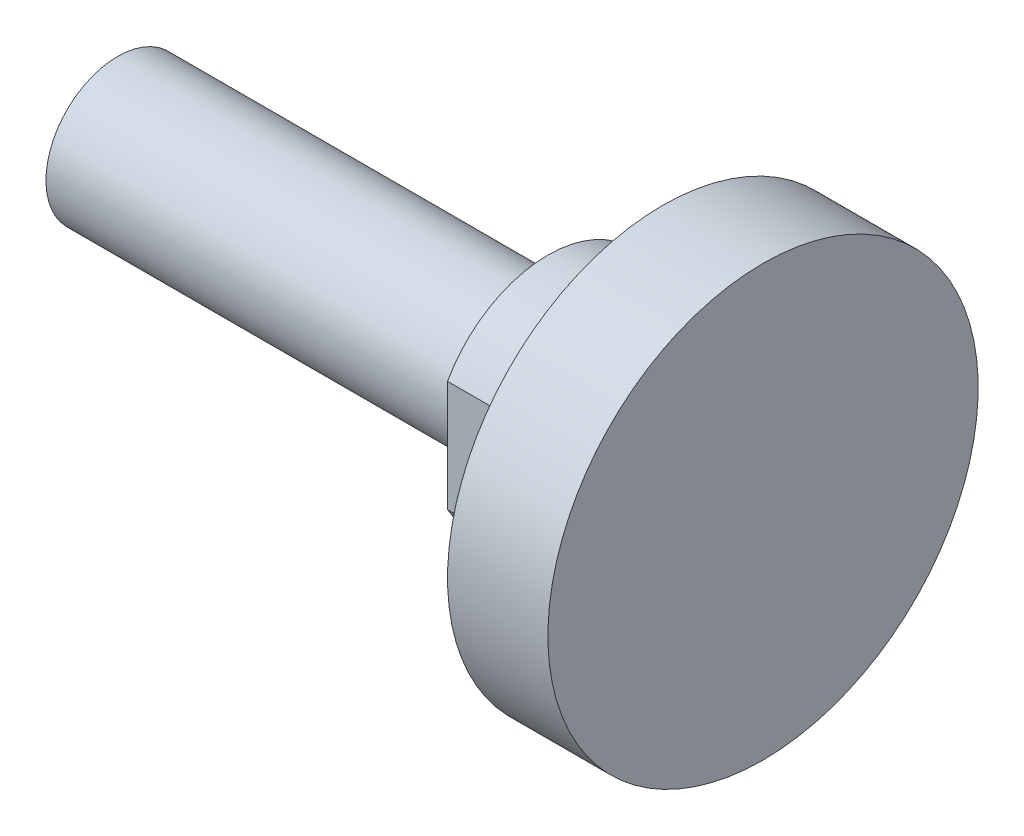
from build123d import *

# Parameters (mm, degrees)
SKETCH_2_W          = 4.66376791
SKETCH_2_H          = 13.576746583
CUT_EXTRUDE_1_DEPTH = 8


with BuildPart() as part:
    # Sketch 1 → Revolve 1 (revolve)
    with BuildSketch(Plane.XY):
        Polygon((0, 0), (30, 0), (30, 3), (38, 3), (38, 10), (45, 10), (45, -5), (0, -5), align=None)
    revolve(axis=Axis((45, -5, 0), (-1, 0, 0)))

    # Sketch 2 → Cut-Extrude 1 (cut)
    with BuildSketch(Plane.ZY.offset(-30)):
        with Locations((-9.331883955, -4.119066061)):
            Rectangle(SKETCH_2_W, SKETCH_2_H)
        with Locations((9.331883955, -4.119066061)):
            Rectangle(SKETCH_2_W, SKETCH_2_H)
    extrude(amount=-CUT_EXTRUDE_1_DEPTH, mode=Mode.SUBTRACT)


solid = part.part
